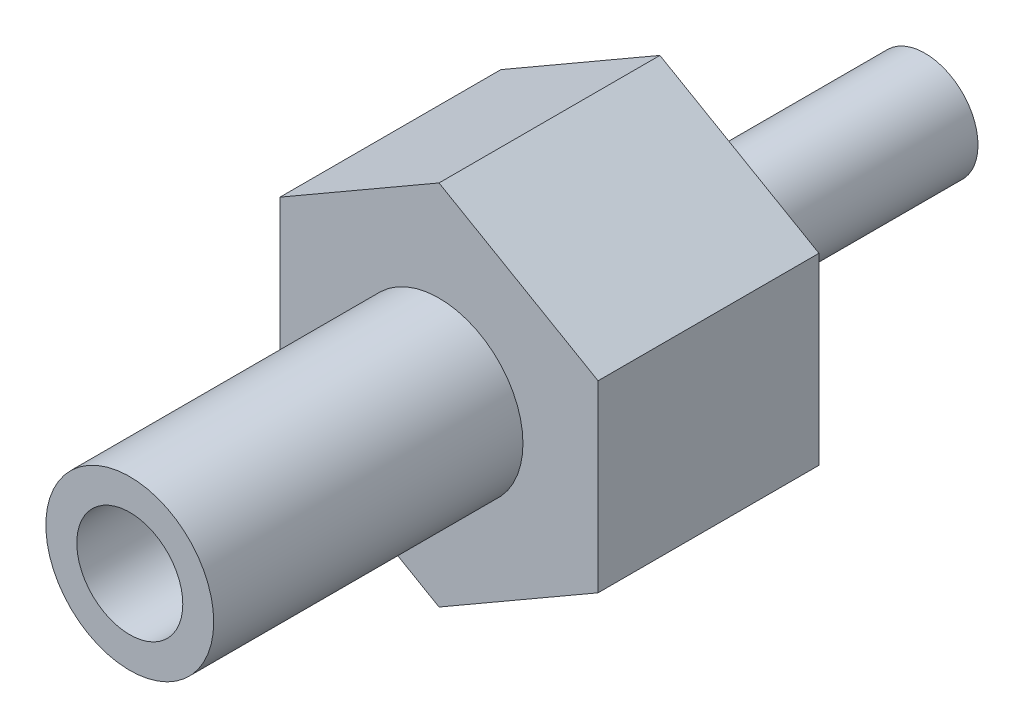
ISO-10303-21;
HEADER;
FILE_DESCRIPTION(('STEP AP214'),'2;1');
FILE_NAME('part.step','',(''),(''),'','','');
FILE_SCHEMA(('AUTOMOTIVE_DESIGN { 1 0 10303 214 1 1 1 1 }'));
ENDSEC;
DATA;
#1=APPLICATION_CONTEXT('core data for automotive mechanical design processes');
#2=APPLICATION_PROTOCOL_DEFINITION('international standard','automotive_design',2000,#1);
#3=PRODUCT_CONTEXT('',#1,'mechanical');
#4=PRODUCT('Part','Part','',(#3));
#5=PRODUCT_RELATED_PRODUCT_CATEGORY('part','',(#4));
#6=PRODUCT_DEFINITION_FORMATION('','',#4);
#7=PRODUCT_DEFINITION_CONTEXT('part definition',#1,'design');
#8=PRODUCT_DEFINITION('design','',#6,#7);
#9=PRODUCT_DEFINITION_SHAPE('','',#8);
#10=(LENGTH_UNIT() NAMED_UNIT(*) SI_UNIT(.MILLI.,.METRE.));
#11=(NAMED_UNIT(*) PLANE_ANGLE_UNIT() SI_UNIT($,.RADIAN.));
#12=(NAMED_UNIT(*) SI_UNIT($,.STERADIAN.) SOLID_ANGLE_UNIT());
#13=UNCERTAINTY_MEASURE_WITH_UNIT(LENGTH_MEASURE(1.E-05),#10,'distance_accuracy_value','');
#14=(GEOMETRIC_REPRESENTATION_CONTEXT(3) GLOBAL_UNCERTAINTY_ASSIGNED_CONTEXT((#13)) GLOBAL_UNIT_ASSIGNED_CONTEXT((#10,
#11,#12)) REPRESENTATION_CONTEXT('',''));
#15=CARTESIAN_POINT('',(0.,0.,0.));
#16=DIRECTION('',(0.,0.,1.));
#17=DIRECTION('',(1.,0.,0.));
#18=AXIS2_PLACEMENT_3D('',#15,#16,#17);
#19=CARTESIAN_POINT('',(6.00000000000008,0.,31.));
#20=DIRECTION('',(0.,0.,-1.));
#21=DIRECTION('',(-1.,0.,0.));
#22=AXIS2_PLACEMENT_3D('',#19,#20,#21);
#23=PLANE('',#22);
#24=CARTESIAN_POINT('',(0.,0.,31.));
#25=DIRECTION('',(0.,0.,1.));
#26=DIRECTION('',(1.,0.,0.));
#27=AXIS2_PLACEMENT_3D('',#24,#25,#26);
#28=CIRCLE('',#27,6.);
#29=CARTESIAN_POINT('',(6.00000000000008,0.,31.));
#30=VERTEX_POINT('',#29);
#31=EDGE_CURVE('E126',#30,#30,#28,.T.);
#32=ORIENTED_EDGE('',*,*,#31,.T.);
#33=EDGE_LOOP('',(#32));
#34=FACE_BOUND('',#33,.T.);
#35=ADVANCED_FACE('F14',(#34),#23,.F.);
#36=CARTESIAN_POINT('',(0.,0.,70.));
#37=DIRECTION('',(0.,0.,1.));
#38=DIRECTION('',(1.,0.,0.));
#39=AXIS2_PLACEMENT_3D('',#36,#37,#38);
#40=CYLINDRICAL_SURFACE('',#39,6.);
#41=ORIENTED_EDGE('',*,*,#31,.F.);
#42=EDGE_LOOP('',(#41));
#43=FACE_BOUND('',#42,.T.);
#44=CARTESIAN_POINT('',(0.,0.,60.));
#45=DIRECTION('',(0.,0.,1.));
#46=DIRECTION('',(1.,0.,0.));
#47=AXIS2_PLACEMENT_3D('',#44,#45,#46);
#48=CIRCLE('',#47,6.);
#49=CARTESIAN_POINT('',(6.00000000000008,0.,60.));
#50=VERTEX_POINT('',#49);
#51=EDGE_CURVE('E123',#50,#50,#48,.T.);
#52=ORIENTED_EDGE('',*,*,#51,.T.);
#53=EDGE_LOOP('',(#52));
#54=FACE_BOUND('',#53,.T.);
#55=ADVANCED_FACE('F149',(#43,#54),#40,.F.);
#56=CARTESIAN_POINT('',(9.5,0.,60.));
#57=DIRECTION('',(0.,0.,-1.));
#58=DIRECTION('',(-1.,0.,0.));
#59=AXIS2_PLACEMENT_3D('',#56,#57,#58);
#60=PLANE('',#59);
#61=ORIENTED_EDGE('',*,*,#51,.F.);
#62=EDGE_LOOP('',(#61));
#63=FACE_BOUND('',#62,.T.);
#64=CARTESIAN_POINT('',(0.,0.,60.));
#65=DIRECTION('',(0.,0.,1.));
#66=DIRECTION('',(1.,0.,0.));
#67=AXIS2_PLACEMENT_3D('',#64,#65,#66);
#68=CIRCLE('',#67,9.5);
#69=CARTESIAN_POINT('',(9.50000000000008,0.,60.));
#70=VERTEX_POINT('',#69);
#71=EDGE_CURVE('E120',#70,#70,#68,.T.);
#72=ORIENTED_EDGE('',*,*,#71,.T.);
#73=EDGE_LOOP('',(#72));
#74=FACE_BOUND('',#73,.T.);
#75=ADVANCED_FACE('F155',(#63,#74),#60,.F.);
#76=CARTESIAN_POINT('',(0.,0.,70.));
#77=DIRECTION('',(0.,0.,1.));
#78=DIRECTION('',(1.,0.,0.));
#79=AXIS2_PLACEMENT_3D('',#76,#77,#78);
#80=CYLINDRICAL_SURFACE('',#79,9.5);
#81=ORIENTED_EDGE('',*,*,#71,.F.);
#82=EDGE_LOOP('',(#81));
#83=FACE_BOUND('',#82,.T.);
#84=CARTESIAN_POINT('',(0.,0.,25.));
#85=DIRECTION('',(0.,0.,1.));
#86=DIRECTION('',(1.,0.,0.));
#87=AXIS2_PLACEMENT_3D('',#84,#85,#86);
#88=CIRCLE('',#87,9.5);
#89=CARTESIAN_POINT('',(9.50000000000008,0.,25.));
#90=VERTEX_POINT('',#89);
#91=EDGE_CURVE('E75',#90,#90,#88,.T.);
#92=ORIENTED_EDGE('',*,*,#91,.T.);
#93=EDGE_LOOP('',(#92));
#94=FACE_BOUND('',#93,.T.);
#95=ADVANCED_FACE('F161',(#83,#94),#80,.T.);
#96=CARTESIAN_POINT('',(22.,0.,25.));
#97=DIRECTION('',(0.,0.,-1.));
#98=DIRECTION('',(-1.,0.,0.));
#99=AXIS2_PLACEMENT_3D('',#96,#97,#98);
#100=PLANE('',#99);
#101=DIRECTION('',(-0.866025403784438,0.5,0.));
#102=VECTOR('',#101,1.);
#103=CARTESIAN_POINT('',(0.,-20.7846096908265,25.));
#104=LINE('',#103,#102);
#105=CARTESIAN_POINT('',(0.,-20.7846096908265,25.));
#106=VERTEX_POINT('',#105);
#107=CARTESIAN_POINT('',(-18.,-10.3923048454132,25.));
#108=VERTEX_POINT('',#107);
#109=EDGE_CURVE('E95',#106,#108,#104,.T.);
#110=ORIENTED_EDGE('',*,*,#109,.F.);
#111=DIRECTION('',(0.866025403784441,0.5,0.));
#112=VECTOR('',#111,1.);
#113=CARTESIAN_POINT('',(0.,-20.7846096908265,25.));
#114=LINE('',#113,#112);
#115=CARTESIAN_POINT('',(18.,-10.3923048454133,25.));
#116=VERTEX_POINT('',#115);
#117=EDGE_CURVE('E37',#106,#116,#114,.T.);
#118=ORIENTED_EDGE('',*,*,#117,.T.);
#119=DIRECTION('',(0.,-1.,0.));
#120=VECTOR('',#119,1.);
#121=CARTESIAN_POINT('',(18.,10.3923048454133,25.));
#122=LINE('',#121,#120);
#123=CARTESIAN_POINT('',(18.,10.3923048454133,25.));
#124=VERTEX_POINT('',#123);
#125=EDGE_CURVE('E74',#124,#116,#122,.T.);
#126=ORIENTED_EDGE('',*,*,#125,.F.);
#127=DIRECTION('',(0.866025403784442,-0.5,0.));
#128=VECTOR('',#127,1.);
#129=CARTESIAN_POINT('',(0.,20.7846096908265,25.));
#130=LINE('',#129,#128);
#131=CARTESIAN_POINT('',(0.,20.7846096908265,25.));
#132=VERTEX_POINT('',#131);
#133=EDGE_CURVE('E104',#132,#124,#130,.T.);
#134=ORIENTED_EDGE('',*,*,#133,.F.);
#135=DIRECTION('',(-0.866025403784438,-0.5,0.));
#136=VECTOR('',#135,1.);
#137=CARTESIAN_POINT('',(0.,20.7846096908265,25.));
#138=LINE('',#137,#136);
#139=CARTESIAN_POINT('',(-18.,10.3923048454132,25.));
#140=VERTEX_POINT('',#139);
#141=EDGE_CURVE('E101',#132,#140,#138,.T.);
#142=ORIENTED_EDGE('',*,*,#141,.T.);
#143=DIRECTION('',(0.,-1.,0.));
#144=VECTOR('',#143,1.);
#145=CARTESIAN_POINT('',(-18.,10.3923048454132,25.));
#146=LINE('',#145,#144);
#147=EDGE_CURVE('E98',#140,#108,#146,.T.);
#148=ORIENTED_EDGE('',*,*,#147,.T.);
#149=EDGE_LOOP('',(#110,#118,#126,#134,#142,#148));
#150=FACE_BOUND('',#149,.T.);
#151=ORIENTED_EDGE('',*,*,#91,.F.);
#152=EDGE_LOOP('',(#151));
#153=FACE_BOUND('',#152,.T.);
#154=ADVANCED_FACE('F165',(#150,#153),#100,.F.);
#155=CARTESIAN_POINT('',(0.,-20.7846096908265,25.));
#156=DIRECTION('',(-0.5,0.866025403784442,0.));
#157=DIRECTION('',(-0.866025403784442,-0.5,0.));
#158=AXIS2_PLACEMENT_3D('',#155,#156,#157);
#159=PLANE('',#158);
#160=DIRECTION('',(0.,0.,-1.));
#161=VECTOR('',#160,1.);
#162=CARTESIAN_POINT('',(18.,-10.3923048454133,25.));
#163=LINE('',#162,#161);
#164=CARTESIAN_POINT('',(18.,-10.3923048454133,0.));
#165=VERTEX_POINT('',#164);
#166=EDGE_CURVE('E67',#116,#165,#163,.T.);
#167=ORIENTED_EDGE('',*,*,#166,.F.);
#168=ORIENTED_EDGE('',*,*,#117,.F.);
#169=DIRECTION('',(0.,0.,-1.));
#170=VECTOR('',#169,1.);
#171=CARTESIAN_POINT('',(0.,-20.7846096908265,25.));
#172=LINE('',#171,#170);
#173=CARTESIAN_POINT('',(0.,-20.7846096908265,0.));
#174=VERTEX_POINT('',#173);
#175=EDGE_CURVE('E81',#106,#174,#172,.T.);
#176=ORIENTED_EDGE('',*,*,#175,.T.);
#177=DIRECTION('',(0.866025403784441,0.5,0.));
#178=VECTOR('',#177,1.);
#179=CARTESIAN_POINT('',(0.,-20.7846096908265,0.));
#180=LINE('',#179,#178);
#181=EDGE_CURVE('E79',#174,#165,#180,.T.);
#182=ORIENTED_EDGE('',*,*,#181,.T.);
#183=EDGE_LOOP('',(#167,#168,#176,#182));
#184=FACE_BOUND('',#183,.T.);
#185=ADVANCED_FACE('F80',(#184),#159,.F.);
#186=CARTESIAN_POINT('',(18.,10.3923048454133,25.));
#187=DIRECTION('',(1.,0.,0.));
#188=DIRECTION('',(0.,1.,0.));
#189=AXIS2_PLACEMENT_3D('',#186,#187,#188);
#190=PLANE('',#189);
#191=DIRECTION('',(0.,0.,-1.));
#192=VECTOR('',#191,1.);
#193=CARTESIAN_POINT('',(18.,10.3923048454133,25.));
#194=LINE('',#193,#192);
#195=CARTESIAN_POINT('',(18.,10.3923048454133,0.));
#196=VERTEX_POINT('',#195);
#197=EDGE_CURVE('E76',#124,#196,#194,.T.);
#198=ORIENTED_EDGE('',*,*,#197,.F.);
#199=ORIENTED_EDGE('',*,*,#125,.T.);
#200=ORIENTED_EDGE('',*,*,#166,.T.);
#201=DIRECTION('',(0.,-1.,0.));
#202=VECTOR('',#201,1.);
#203=CARTESIAN_POINT('',(18.,10.3923048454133,0.));
#204=LINE('',#203,#202);
#205=EDGE_CURVE('E71',#196,#165,#204,.T.);
#206=ORIENTED_EDGE('',*,*,#205,.F.);
#207=EDGE_LOOP('',(#198,#199,#200,#206));
#208=FACE_BOUND('',#207,.T.);
#209=ADVANCED_FACE('F69',(#208),#190,.T.);
#210=CARTESIAN_POINT('',(0.,20.7846096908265,25.));
#211=DIRECTION('',(0.5,0.866025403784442,0.));
#212=DIRECTION('',(-0.866025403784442,0.5,0.));
#213=AXIS2_PLACEMENT_3D('',#210,#211,#212);
#214=PLANE('',#213);
#215=DIRECTION('',(0.,0.,-1.));
#216=VECTOR('',#215,1.);
#217=CARTESIAN_POINT('',(0.,20.7846096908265,25.));
#218=LINE('',#217,#216);
#219=CARTESIAN_POINT('',(0.,20.7846096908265,0.));
#220=VERTEX_POINT('',#219);
#221=EDGE_CURVE('E115',#132,#220,#218,.T.);
#222=ORIENTED_EDGE('',*,*,#221,.F.);
#223=ORIENTED_EDGE('',*,*,#133,.T.);
#224=ORIENTED_EDGE('',*,*,#197,.T.);
#225=DIRECTION('',(0.866025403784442,-0.5,0.));
#226=VECTOR('',#225,1.);
#227=CARTESIAN_POINT('',(0.,20.7846096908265,0.));
#228=LINE('',#227,#226);
#229=EDGE_CURVE('E89',#220,#196,#228,.T.);
#230=ORIENTED_EDGE('',*,*,#229,.F.);
#231=EDGE_LOOP('',(#222,#223,#224,#230));
#232=FACE_BOUND('',#231,.T.);
#233=ADVANCED_FACE('F172',(#232),#214,.T.);
#234=CARTESIAN_POINT('',(0.,20.7846096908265,25.));
#235=DIRECTION('',(0.5,-0.866025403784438,0.));
#236=DIRECTION('',(0.866025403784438,0.5,0.));
#237=AXIS2_PLACEMENT_3D('',#234,#235,#236);
#238=PLANE('',#237);
#239=DIRECTION('',(0.,0.,-1.));
#240=VECTOR('',#239,1.);
#241=CARTESIAN_POINT('',(-18.,10.3923048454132,25.));
#242=LINE('',#241,#240);
#243=CARTESIAN_POINT('',(-18.,10.3923048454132,0.));
#244=VERTEX_POINT('',#243);
#245=EDGE_CURVE('E113',#140,#244,#242,.T.);
#246=ORIENTED_EDGE('',*,*,#245,.F.);
#247=ORIENTED_EDGE('',*,*,#141,.F.);
#248=ORIENTED_EDGE('',*,*,#221,.T.);
#249=DIRECTION('',(-0.866025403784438,-0.5,0.));
#250=VECTOR('',#249,1.);
#251=CARTESIAN_POINT('',(0.,20.7846096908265,0.));
#252=LINE('',#251,#250);
#253=EDGE_CURVE('E91',#220,#244,#252,.T.);
#254=ORIENTED_EDGE('',*,*,#253,.T.);
#255=EDGE_LOOP('',(#246,#247,#248,#254));
#256=FACE_BOUND('',#255,.T.);
#257=ADVANCED_FACE('F175',(#256),#238,.F.);
#258=CARTESIAN_POINT('',(-18.,10.3923048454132,25.));
#259=DIRECTION('',(1.,0.,0.));
#260=DIRECTION('',(0.,1.,0.));
#261=AXIS2_PLACEMENT_3D('',#258,#259,#260);
#262=PLANE('',#261);
#263=DIRECTION('',(0.,0.,-1.));
#264=VECTOR('',#263,1.);
#265=CARTESIAN_POINT('',(-18.,-10.3923048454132,25.));
#266=LINE('',#265,#264);
#267=CARTESIAN_POINT('',(-18.,-10.3923048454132,0.));
#268=VERTEX_POINT('',#267);
#269=EDGE_CURVE('E111',#108,#268,#266,.T.);
#270=ORIENTED_EDGE('',*,*,#269,.F.);
#271=ORIENTED_EDGE('',*,*,#147,.F.);
#272=ORIENTED_EDGE('',*,*,#245,.T.);
#273=DIRECTION('',(0.,-1.,0.));
#274=VECTOR('',#273,1.);
#275=CARTESIAN_POINT('',(-18.,10.3923048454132,0.));
#276=LINE('',#275,#274);
#277=EDGE_CURVE('E29',#244,#268,#276,.T.);
#278=ORIENTED_EDGE('',*,*,#277,.T.);
#279=EDGE_LOOP('',(#270,#271,#272,#278));
#280=FACE_BOUND('',#279,.T.);
#281=ADVANCED_FACE('F144',(#280),#262,.F.);
#282=CARTESIAN_POINT('',(0.,-20.7846096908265,25.));
#283=DIRECTION('',(-0.5,-0.866025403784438,0.));
#284=DIRECTION('',(0.866025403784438,-0.5,0.));
#285=AXIS2_PLACEMENT_3D('',#282,#283,#284);
#286=PLANE('',#285);
#287=ORIENTED_EDGE('',*,*,#109,.T.);
#288=ORIENTED_EDGE('',*,*,#269,.T.);
#289=DIRECTION('',(-0.866025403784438,0.5,0.));
#290=VECTOR('',#289,1.);
#291=CARTESIAN_POINT('',(0.,-20.7846096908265,0.));
#292=LINE('',#291,#290);
#293=EDGE_CURVE('E109',#174,#268,#292,.T.);
#294=ORIENTED_EDGE('',*,*,#293,.F.);
#295=ORIENTED_EDGE('',*,*,#175,.F.);
#296=EDGE_LOOP('',(#287,#288,#294,#295));
#297=FACE_BOUND('',#296,.T.);
#298=ADVANCED_FACE('F135',(#297),#286,.T.);
#299=CARTESIAN_POINT('',(0.,0.,-30.));
#300=DIRECTION('',(0.,0.,1.));
#301=DIRECTION('',(1.,0.,0.));
#302=AXIS2_PLACEMENT_3D('',#299,#300,#301);
#303=PLANE('',#302);
#304=CARTESIAN_POINT('',(0.,0.,-30.));
#305=DIRECTION('',(0.,0.,1.));
#306=DIRECTION('',(1.,0.,0.));
#307=AXIS2_PLACEMENT_3D('',#304,#305,#306);
#308=CIRCLE('',#307,5.99999999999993);
#309=CARTESIAN_POINT('',(6.00000000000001,0.,-30.));
#310=VERTEX_POINT('',#309);
#311=EDGE_CURVE('E22',#310,#310,#308,.T.);
#312=ORIENTED_EDGE('',*,*,#311,.F.);
#313=EDGE_LOOP('',(#312));
#314=FACE_BOUND('',#313,.T.);
#315=ADVANCED_FACE('F133',(#314),#303,.F.);
#316=CARTESIAN_POINT('',(0.,0.,70.));
#317=DIRECTION('',(0.,0.,1.));
#318=DIRECTION('',(1.,0.,0.));
#319=AXIS2_PLACEMENT_3D('',#316,#317,#318);
#320=CYLINDRICAL_SURFACE('',#319,6.);
#321=CARTESIAN_POINT('',(0.,0.,0.));
#322=DIRECTION('',(0.,0.,1.));
#323=DIRECTION('',(1.,0.,0.));
#324=AXIS2_PLACEMENT_3D('',#321,#322,#323);
#325=CIRCLE('',#324,6.);
#326=CARTESIAN_POINT('',(6.00000000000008,0.,0.));
#327=VERTEX_POINT('',#326);
#328=EDGE_CURVE('E9',#327,#327,#325,.T.);
#329=ORIENTED_EDGE('',*,*,#328,.F.);
#330=EDGE_LOOP('',(#329));
#331=FACE_BOUND('',#330,.T.);
#332=ORIENTED_EDGE('',*,*,#311,.T.);
#333=EDGE_LOOP('',(#332));
#334=FACE_BOUND('',#333,.T.);
#335=ADVANCED_FACE('F131',(#331,#334),#320,.T.);
#336=CARTESIAN_POINT('',(6.00000000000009,0.,0.));
#337=DIRECTION('',(0.,0.,1.));
#338=DIRECTION('',(1.,0.,0.));
#339=AXIS2_PLACEMENT_3D('',#336,#337,#338);
#340=PLANE('',#339);
#341=ORIENTED_EDGE('',*,*,#205,.T.);
#342=ORIENTED_EDGE('',*,*,#181,.F.);
#343=ORIENTED_EDGE('',*,*,#293,.T.);
#344=ORIENTED_EDGE('',*,*,#277,.F.);
#345=ORIENTED_EDGE('',*,*,#253,.F.);
#346=ORIENTED_EDGE('',*,*,#229,.T.);
#347=EDGE_LOOP('',(#341,#342,#343,#344,#345,#346));
#348=FACE_BOUND('',#347,.T.);
#349=ORIENTED_EDGE('',*,*,#328,.T.);
#350=EDGE_LOOP('',(#349));
#351=FACE_BOUND('',#350,.T.);
#352=ADVANCED_FACE('F16',(#348,#351),#340,.F.);
#353=CLOSED_SHELL('',(#35,#55,#75,#95,#154,#185,#209,#233,#257,#281,#298,#315,#335,#352));
#354=MANIFOLD_SOLID_BREP('B1',#353);
#355=ADVANCED_BREP_SHAPE_REPRESENTATION('',(#18,#354),#14);
#356=SHAPE_DEFINITION_REPRESENTATION(#9,#355);
ENDSEC;
END-ISO-10303-21;
